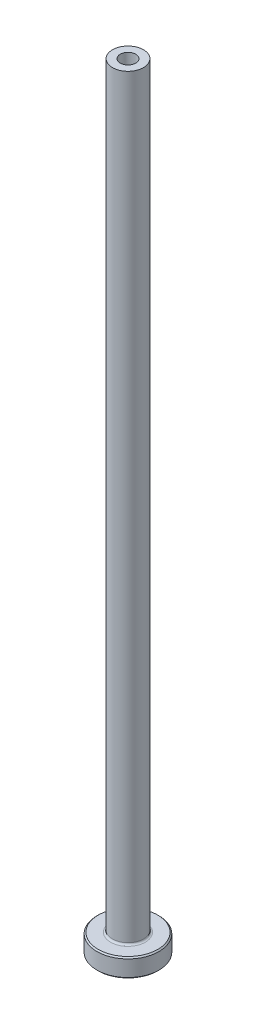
ISO-10303-21;
HEADER;
FILE_DESCRIPTION(('STEP AP214'),'2;1');
FILE_NAME('part.step','',(''),(''),'','','');
FILE_SCHEMA(('AUTOMOTIVE_DESIGN { 1 0 10303 214 1 1 1 1 }'));
ENDSEC;
DATA;
#1=APPLICATION_CONTEXT('core data for automotive mechanical design processes');
#2=APPLICATION_PROTOCOL_DEFINITION('international standard','automotive_design',2000,#1);
#3=PRODUCT_CONTEXT('',#1,'mechanical');
#4=PRODUCT('Part','Part','',(#3));
#5=PRODUCT_RELATED_PRODUCT_CATEGORY('part','',(#4));
#6=PRODUCT_DEFINITION_FORMATION('','',#4);
#7=PRODUCT_DEFINITION_CONTEXT('part definition',#1,'design');
#8=PRODUCT_DEFINITION('design','',#6,#7);
#9=PRODUCT_DEFINITION_SHAPE('','',#8);
#10=(LENGTH_UNIT() NAMED_UNIT(*) SI_UNIT(.MILLI.,.METRE.));
#11=(NAMED_UNIT(*) PLANE_ANGLE_UNIT() SI_UNIT($,.RADIAN.));
#12=(NAMED_UNIT(*) SI_UNIT($,.STERADIAN.) SOLID_ANGLE_UNIT());
#13=UNCERTAINTY_MEASURE_WITH_UNIT(LENGTH_MEASURE(1.E-05),#10,'distance_accuracy_value','');
#14=(GEOMETRIC_REPRESENTATION_CONTEXT(3) GLOBAL_UNCERTAINTY_ASSIGNED_CONTEXT((#13)) GLOBAL_UNIT_ASSIGNED_CONTEXT((#10,
#11,#12)) REPRESENTATION_CONTEXT('',''));
#15=CARTESIAN_POINT('',(0.,0.,0.));
#16=DIRECTION('',(0.,0.,1.));
#17=DIRECTION('',(1.,0.,0.));
#18=AXIS2_PLACEMENT_3D('',#15,#16,#17);
#19=CARTESIAN_POINT('',(0.,92.1876809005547,0.));
#20=DIRECTION('',(0.,1.,0.));
#21=DIRECTION('',(0.,0.,1.));
#22=AXIS2_PLACEMENT_3D('',#19,#20,#21);
#23=CYLINDRICAL_SURFACE('',#22,1.25);
#24=CARTESIAN_POINT('',(0.,125.,0.));
#25=DIRECTION('',(0.,1.,0.));
#26=DIRECTION('',(0.,0.,1.));
#27=AXIS2_PLACEMENT_3D('',#24,#25,#26);
#28=CIRCLE('',#27,1.25);
#29=CARTESIAN_POINT('',(0.,125.,1.25));
#30=VERTEX_POINT('',#29);
#31=EDGE_CURVE('E62',#30,#30,#28,.T.);
#32=ORIENTED_EDGE('',*,*,#31,.T.);
#33=EDGE_LOOP('',(#32));
#34=FACE_BOUND('',#33,.T.);
#35=CARTESIAN_POINT('',(0.,90.,0.));
#36=DIRECTION('',(0.,1.,0.));
#37=DIRECTION('',(0.,0.,1.));
#38=AXIS2_PLACEMENT_3D('',#35,#36,#37);
#39=CIRCLE('',#38,1.25);
#40=CARTESIAN_POINT('',(0.,90.,1.25));
#41=VERTEX_POINT('',#40);
#42=EDGE_CURVE('E71',#41,#41,#39,.T.);
#43=ORIENTED_EDGE('',*,*,#42,.F.);
#44=EDGE_LOOP('',(#43));
#45=FACE_BOUND('',#44,.T.);
#46=ADVANCED_FACE('F30',(#34,#45),#23,.F.);
#47=CARTESIAN_POINT('',(-1.25,125.,0.));
#48=DIRECTION('',(0.,1.,0.));
#49=DIRECTION('',(0.,0.,1.));
#50=AXIS2_PLACEMENT_3D('',#47,#48,#49);
#51=PLANE('',#50);
#52=CARTESIAN_POINT('',(0.,125.,0.));
#53=DIRECTION('',(0.,1.,0.));
#54=DIRECTION('',(0.,0.,1.));
#55=AXIS2_PLACEMENT_3D('',#52,#53,#54);
#56=CIRCLE('',#55,2.5);
#57=CARTESIAN_POINT('',(0.,125.,2.5));
#58=VERTEX_POINT('',#57);
#59=EDGE_CURVE('E65',#58,#58,#56,.T.);
#60=ORIENTED_EDGE('',*,*,#59,.T.);
#61=EDGE_LOOP('',(#60));
#62=FACE_BOUND('',#61,.T.);
#63=ORIENTED_EDGE('',*,*,#31,.F.);
#64=EDGE_LOOP('',(#63));
#65=FACE_BOUND('',#64,.T.);
#66=ADVANCED_FACE('F79',(#62,#65),#51,.T.);
#67=CARTESIAN_POINT('',(0.,92.1876809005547,0.));
#68=DIRECTION('',(0.,1.,0.));
#69=DIRECTION('',(0.,0.,1.));
#70=AXIS2_PLACEMENT_3D('',#67,#68,#69);
#71=CYLINDRICAL_SURFACE('',#70,2.5);
#72=CARTESIAN_POINT('',(0.,3.3,0.));
#73=DIRECTION('',(0.,1.,0.));
#74=DIRECTION('',(0.,0.,1.));
#75=AXIS2_PLACEMENT_3D('',#72,#73,#74);
#76=CIRCLE('',#75,2.5);
#77=CARTESIAN_POINT('',(0.,3.3,2.5));
#78=VERTEX_POINT('',#77);
#79=EDGE_CURVE('E59',#78,#78,#76,.T.);
#80=ORIENTED_EDGE('',*,*,#79,.T.);
#81=EDGE_LOOP('',(#80));
#82=FACE_BOUND('',#81,.T.);
#83=ORIENTED_EDGE('',*,*,#59,.F.);
#84=EDGE_LOOP('',(#83));
#85=FACE_BOUND('',#84,.T.);
#86=ADVANCED_FACE('F85',(#82,#85),#71,.T.);
#87=CARTESIAN_POINT('',(-2.49999999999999,3.,0.));
#88=DIRECTION('',(0.,1.,0.));
#89=DIRECTION('',(0.,0.,1.));
#90=AXIS2_PLACEMENT_3D('',#87,#88,#89);
#91=PLANE('',#90);
#92=CARTESIAN_POINT('',(0.,3.,0.));
#93=DIRECTION('',(0.,1.,0.));
#94=DIRECTION('',(0.,0.,1.));
#95=AXIS2_PLACEMENT_3D('',#92,#93,#94);
#96=CIRCLE('',#95,4.80000000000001);
#97=CARTESIAN_POINT('',(0.,3.,4.80000000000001));
#98=VERTEX_POINT('',#97);
#99=EDGE_CURVE('E53',#98,#98,#96,.T.);
#100=ORIENTED_EDGE('',*,*,#99,.T.);
#101=EDGE_LOOP('',(#100));
#102=FACE_BOUND('',#101,.T.);
#103=CARTESIAN_POINT('',(0.,3.,0.));
#104=DIRECTION('',(0.,1.,0.));
#105=DIRECTION('',(0.,0.,1.));
#106=AXIS2_PLACEMENT_3D('',#103,#104,#105);
#107=CIRCLE('',#106,2.8);
#108=CARTESIAN_POINT('',(0.,3.,2.8));
#109=VERTEX_POINT('',#108);
#110=EDGE_CURVE('E56',#109,#109,#107,.F.);
#111=ORIENTED_EDGE('',*,*,#110,.T.);
#112=EDGE_LOOP('',(#111));
#113=FACE_BOUND('',#112,.T.);
#114=ADVANCED_FACE('F111',(#102,#113),#91,.T.);
#115=CARTESIAN_POINT('',(0.,92.1876809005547,0.));
#116=DIRECTION('',(0.,1.,0.));
#117=DIRECTION('',(0.,0.,1.));
#118=AXIS2_PLACEMENT_3D('',#115,#116,#117);
#119=CYLINDRICAL_SURFACE('',#118,4.99999999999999);
#120=CARTESIAN_POINT('',(0.,2.80000000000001,0.));
#121=DIRECTION('',(0.,1.,0.));
#122=DIRECTION('',(0.,0.,1.));
#123=AXIS2_PLACEMENT_3D('',#120,#121,#122);
#124=CIRCLE('',#123,4.99999999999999);
#125=CARTESIAN_POINT('',(0.,2.80000000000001,4.99999999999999));
#126=VERTEX_POINT('',#125);
#127=EDGE_CURVE('E45',#126,#126,#124,.F.);
#128=ORIENTED_EDGE('',*,*,#127,.T.);
#129=EDGE_LOOP('',(#128));
#130=FACE_BOUND('',#129,.T.);
#131=CARTESIAN_POINT('',(0.,0.20000000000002,0.));
#132=DIRECTION('',(0.,-1.,0.));
#133=DIRECTION('',(0.,0.,-1.));
#134=AXIS2_PLACEMENT_3D('',#131,#132,#133);
#135=CIRCLE('',#134,4.99999999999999);
#136=CARTESIAN_POINT('',(0.,0.20000000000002,-4.99999999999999));
#137=VERTEX_POINT('',#136);
#138=EDGE_CURVE('E50',#137,#137,#135,.F.);
#139=ORIENTED_EDGE('',*,*,#138,.T.);
#140=EDGE_LOOP('',(#139));
#141=FACE_BOUND('',#140,.T.);
#142=ADVANCED_FACE('F108',(#130,#141),#119,.T.);
#143=CARTESIAN_POINT('',(-4.99999999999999,0.,0.));
#144=DIRECTION('',(0.,-1.,0.));
#145=DIRECTION('',(0.,0.,-1.));
#146=AXIS2_PLACEMENT_3D('',#143,#144,#145);
#147=PLANE('',#146);
#148=CARTESIAN_POINT('',(0.,0.,0.));
#149=DIRECTION('',(0.,-1.,0.));
#150=DIRECTION('',(0.,0.,-1.));
#151=AXIS2_PLACEMENT_3D('',#148,#149,#150);
#152=CIRCLE('',#151,1.99999999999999);
#153=CARTESIAN_POINT('',(0.,0.,-1.99999999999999));
#154=VERTEX_POINT('',#153);
#155=EDGE_CURVE('E37',#154,#154,#152,.F.);
#156=ORIENTED_EDGE('',*,*,#155,.T.);
#157=EDGE_LOOP('',(#156));
#158=FACE_BOUND('',#157,.T.);
#159=CARTESIAN_POINT('',(0.,0.,0.));
#160=DIRECTION('',(0.,-1.,0.));
#161=DIRECTION('',(0.,0.,-1.));
#162=AXIS2_PLACEMENT_3D('',#159,#160,#161);
#163=CIRCLE('',#162,4.79999999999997);
#164=CARTESIAN_POINT('',(0.,0.,-4.79999999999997));
#165=VERTEX_POINT('',#164);
#166=EDGE_CURVE('E41',#165,#165,#163,.T.);
#167=ORIENTED_EDGE('',*,*,#166,.T.);
#168=EDGE_LOOP('',(#167));
#169=FACE_BOUND('',#168,.T.);
#170=ADVANCED_FACE('F110',(#158,#169),#147,.T.);
#171=CARTESIAN_POINT('',(0.,92.1876809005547,0.));
#172=DIRECTION('',(0.,1.,0.));
#173=DIRECTION('',(0.,0.,1.));
#174=AXIS2_PLACEMENT_3D('',#171,#172,#173);
#175=CYLINDRICAL_SURFACE('',#174,1.5);
#176=CARTESIAN_POINT('',(0.,0.499999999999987,0.));
#177=DIRECTION('',(0.,-1.,0.));
#178=DIRECTION('',(0.,0.,-1.));
#179=AXIS2_PLACEMENT_3D('',#176,#177,#178);
#180=CIRCLE('',#179,1.5);
#181=CARTESIAN_POINT('',(0.,0.499999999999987,-1.5));
#182=VERTEX_POINT('',#181);
#183=EDGE_CURVE('E10',#182,#182,#180,.T.);
#184=ORIENTED_EDGE('',*,*,#183,.T.);
#185=EDGE_LOOP('',(#184));
#186=FACE_BOUND('',#185,.T.);
#187=CARTESIAN_POINT('',(0.,78.,0.));
#188=DIRECTION('',(0.,1.,0.));
#189=DIRECTION('',(0.,0.,1.));
#190=AXIS2_PLACEMENT_3D('',#187,#188,#189);
#191=CIRCLE('',#190,1.5);
#192=CARTESIAN_POINT('',(0.,78.,1.5));
#193=VERTEX_POINT('',#192);
#194=EDGE_CURVE('E68',#193,#193,#191,.T.);
#195=ORIENTED_EDGE('',*,*,#194,.T.);
#196=EDGE_LOOP('',(#195));
#197=FACE_BOUND('',#196,.T.);
#198=ADVANCED_FACE('F118',(#186,#197),#175,.F.);
#199=CARTESIAN_POINT('',(0.,78.,0.));
#200=DIRECTION('',(0.,-1.,0.));
#201=DIRECTION('',(0.,0.,-1.));
#202=AXIS2_PLACEMENT_3D('',#199,#200,#201);
#203=CONICAL_SURFACE('',#202,1.5,0.0208303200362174);
#204=ORIENTED_EDGE('',*,*,#42,.T.);
#205=EDGE_LOOP('',(#204));
#206=FACE_BOUND('',#205,.T.);
#207=ORIENTED_EDGE('',*,*,#194,.F.);
#208=EDGE_LOOP('',(#207));
#209=FACE_BOUND('',#208,.T.);
#210=ADVANCED_FACE('F75',(#206,#209),#203,.F.);
#211=CARTESIAN_POINT('',(0.,3.3,0.));
#212=DIRECTION('',(0.,1.,0.));
#213=DIRECTION('',(0.,0.,1.));
#214=AXIS2_PLACEMENT_3D('',#211,#212,#213);
#215=TOROIDAL_SURFACE('',#214,2.8,0.3);
#216=ORIENTED_EDGE('',*,*,#110,.F.);
#217=EDGE_LOOP('',(#216));
#218=FACE_BOUND('',#217,.T.);
#219=ORIENTED_EDGE('',*,*,#79,.F.);
#220=EDGE_LOOP('',(#219));
#221=FACE_BOUND('',#220,.T.);
#222=ADVANCED_FACE('F90',(#218,#221),#215,.F.);
#223=CARTESIAN_POINT('',(0.,3.,0.));
#224=DIRECTION('',(0.,-1.,0.));
#225=DIRECTION('',(0.,0.,-1.));
#226=AXIS2_PLACEMENT_3D('',#223,#224,#225);
#227=CONICAL_SURFACE('',#226,4.80000000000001,0.785398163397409);
#228=ORIENTED_EDGE('',*,*,#127,.F.);
#229=EDGE_LOOP('',(#228));
#230=FACE_BOUND('',#229,.T.);
#231=ORIENTED_EDGE('',*,*,#99,.F.);
#232=EDGE_LOOP('',(#231));
#233=FACE_BOUND('',#232,.T.);
#234=ADVANCED_FACE('F93',(#230,#233),#227,.T.);
#235=CARTESIAN_POINT('',(0.,0.20000000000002,0.));
#236=DIRECTION('',(0.,1.,0.));
#237=DIRECTION('',(0.,0.,1.));
#238=AXIS2_PLACEMENT_3D('',#235,#236,#237);
#239=CONICAL_SURFACE('',#238,4.99999999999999,0.785398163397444);
#240=ORIENTED_EDGE('',*,*,#166,.F.);
#241=EDGE_LOOP('',(#240));
#242=FACE_BOUND('',#241,.T.);
#243=ORIENTED_EDGE('',*,*,#138,.F.);
#244=EDGE_LOOP('',(#243));
#245=FACE_BOUND('',#244,.T.);
#246=ADVANCED_FACE('F96',(#242,#245),#239,.T.);
#247=CARTESIAN_POINT('',(0.,0.,0.));
#248=DIRECTION('',(0.,-1.,0.));
#249=DIRECTION('',(0.,0.,-1.));
#250=AXIS2_PLACEMENT_3D('',#247,#248,#249);
#251=CONICAL_SURFACE('',#250,1.99999999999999,0.785398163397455);
#252=ORIENTED_EDGE('',*,*,#183,.F.);
#253=EDGE_LOOP('',(#252));
#254=FACE_BOUND('',#253,.T.);
#255=ORIENTED_EDGE('',*,*,#155,.F.);
#256=EDGE_LOOP('',(#255));
#257=FACE_BOUND('',#256,.T.);
#258=ADVANCED_FACE('F32',(#254,#257),#251,.F.);
#259=CLOSED_SHELL('',(#46,#66,#86,#114,#142,#170,#198,#210,#222,#234,#246,#258));
#260=MANIFOLD_SOLID_BREP('B2',#259);
#261=ADVANCED_BREP_SHAPE_REPRESENTATION('',(#18,#260),#14);
#262=SHAPE_DEFINITION_REPRESENTATION(#9,#261);
ENDSEC;
END-ISO-10303-21;
